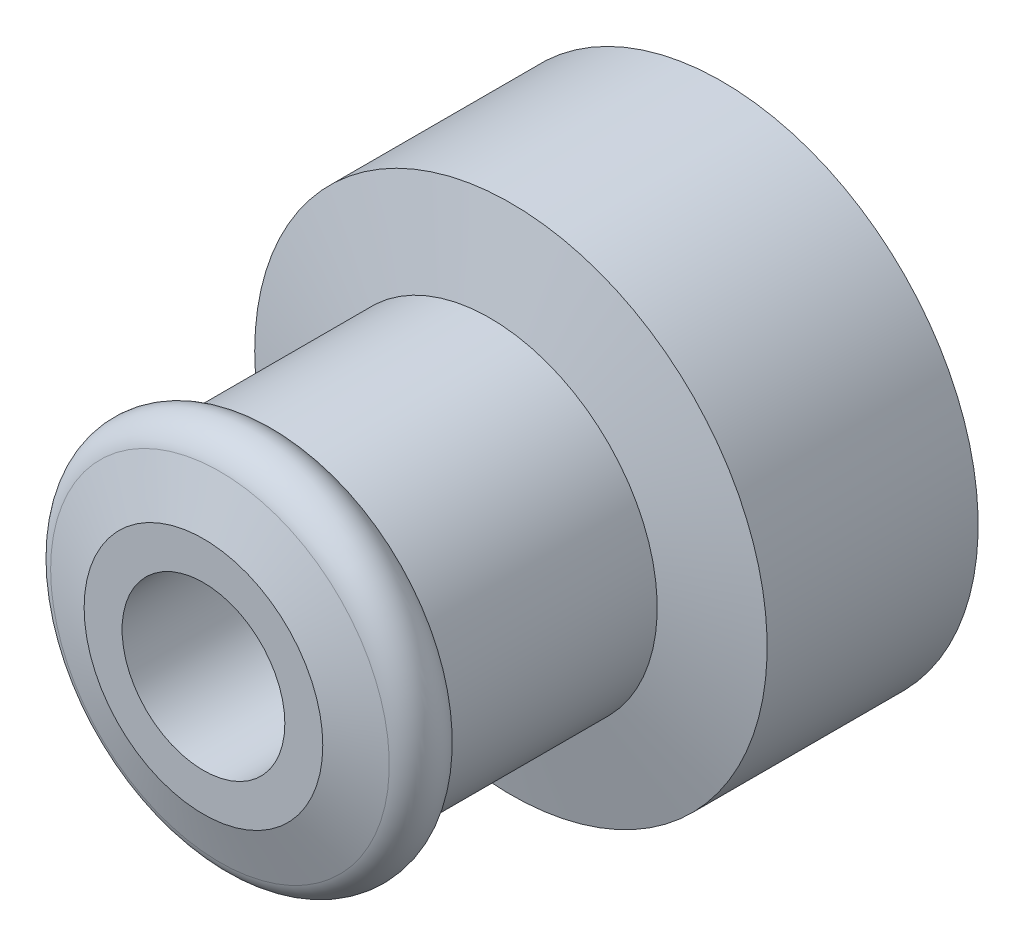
from build123d import *

# Parameters (mm, degrees)
BORE_START          = 1
SKETCH_2_R          = 2.7
BORE_DEPTH          = 22.98427983
FIX_START           = 3.2
SKETCH_4_R          = 1.7
FIX_2_DEPTH         = 18.78427983
CUT_EXTRUDE_START   = 2.5
SKETCH_4_3_R        = 1.7
CUT_EXTRUDE_1_DEPTH = 2.8
MOVE_BODY_1_ANGLE   = 90
FILLET_1_R          = 0.15


with BuildPart() as part:
    # Sketch 1 → Body (revolve)
    with BuildSketch(Plane.XY, mode=Mode.PRIVATE) as body_sk:
        with BuildLine():
            Line((0, 8.5), (0, 0))
            Line((0, 0), (17.2, 0))
            Line((17.2, 0), (17.2, 3.958583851))
            Line((17.2, 3.958583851), (16.652924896, 5.61704678))
            ThreePointArc((16.652924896, 5.61704678), (15.650028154, 6.31642018), (14.697387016, 5.55))
            Line((14.697387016, 5.55), (7.697387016, 5.55))
            Line((7.697387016, 5.55), (7, 8.5))
            Line((7, 8.5), (0, 8.5))
        make_face()
    revolve(body_sk.sketch.rotate(Axis((0, 0, 0), (1, 0, 0)), 90), axis=Axis((0, 0, 0), (1, 0, 0)))

    # Sketch 2 → Bore (cut, through all)
    with BuildSketch(Plane(origin=(17.2, 0, 0), x_dir=(0, 0, -1), z_dir=(1, 0, 0)).offset(BORE_START)):
        Circle(SKETCH_2_R)
    extrude(amount=-BORE_DEPTH, mode=Mode.SUBTRACT)

    # Sketch 4 → Fix 2 (cut, through all)
    with BuildSketch(Plane.XY.offset(FIX_START)):
        with Locations((3.5, 0)):
            Circle(SKETCH_4_R)
    extrude(amount=FIX_2_DEPTH, mode=Mode.SUBTRACT)

    # Sketch 4_3 → Cut-Extrude 1 (cut)
    # profile 1 of 2: a face of its own
    with BuildSketch(Plane.XY.offset(CUT_EXTRUDE_START)):
        Polygon((-1.112463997, 2.806157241), (-1.112463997, -2.806157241), (1.825684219, -2.806157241), (5.120135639, -2.806157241), (6.740271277, 0), (5.120135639, 2.806157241), (1.825684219, 2.806157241), align=None)
        with Locations((3.5, 0)):
            Circle(SKETCH_4_3_R, mode=Mode.SUBTRACT)
    # profile 2 of 2: a face of its own
    with BuildSketch(Plane.XY.offset(CUT_EXTRUDE_START)):
        with Locations((3.5, 0)):
            Circle(SKETCH_4_3_R)
    extrude(amount=CUT_EXTRUDE_1_DEPTH, mode=Mode.SUBTRACT)


with BuildPart() as part_1:
    # Move Body 1: moved
    add(part.part.rotate(Axis((8, 0, 0), (0, -1, 0)), MOVE_BODY_1_ANGLE))

    # Fillet 1
    fillet_1_edges = [part_1.edges().sort_by_distance(p)[0] for p in [
        (5.5, 1.019803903, -4.92425639),
        (5.5, -1.019803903, -4.92425639),
    ]]
    fillet(fillet_1_edges, radius=FILLET_1_R)


solid = part_1.part
